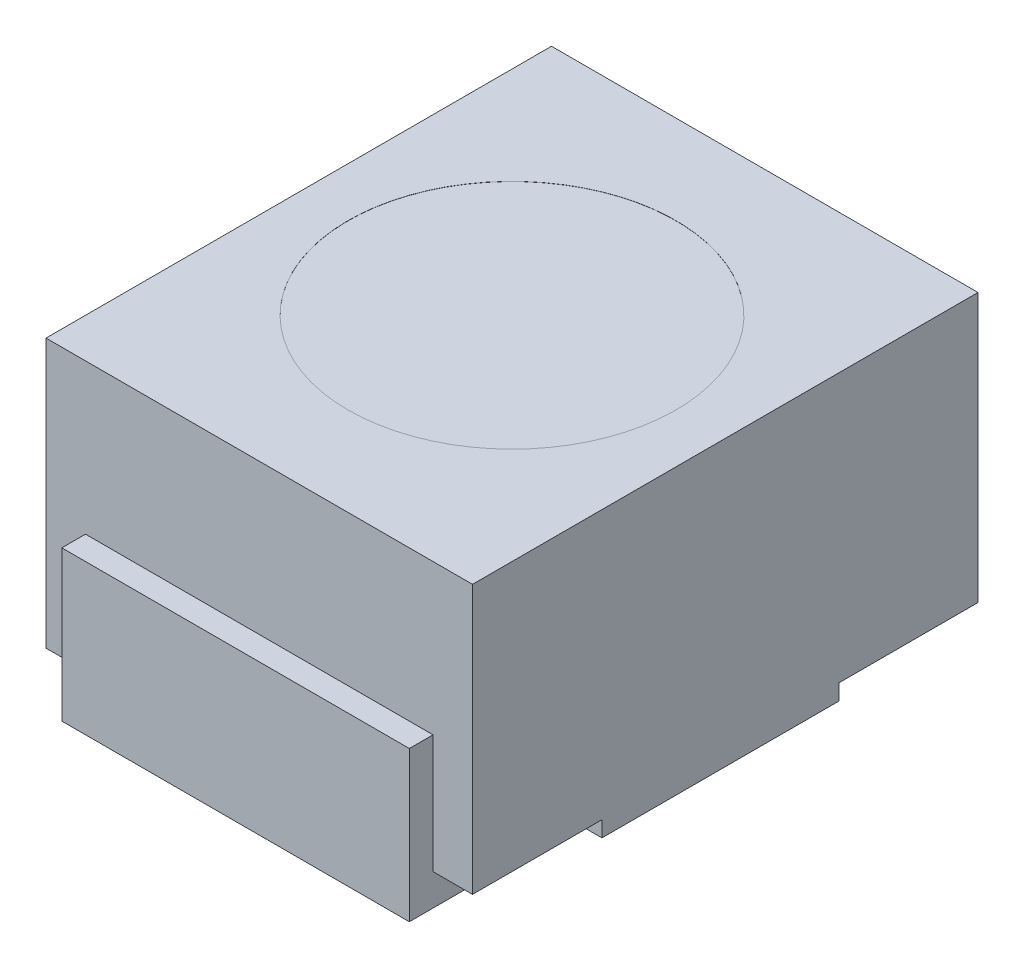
ISO-10303-21;
HEADER;
FILE_DESCRIPTION(('STEP AP214'),'2;1');
FILE_NAME('part.step','',(''),(''),'','','');
FILE_SCHEMA(('AUTOMOTIVE_DESIGN { 1 0 10303 214 1 1 1 1 }'));
ENDSEC;
DATA;
#1=APPLICATION_CONTEXT('core data for automotive mechanical design processes');
#2=APPLICATION_PROTOCOL_DEFINITION('international standard','automotive_design',2000,#1);
#3=PRODUCT_CONTEXT('',#1,'mechanical');
#4=PRODUCT('Part','Part','',(#3));
#5=PRODUCT_RELATED_PRODUCT_CATEGORY('part','',(#4));
#6=PRODUCT_DEFINITION_FORMATION('','',#4);
#7=PRODUCT_DEFINITION_CONTEXT('part definition',#1,'design');
#8=PRODUCT_DEFINITION('design','',#6,#7);
#9=PRODUCT_DEFINITION_SHAPE('','',#8);
#10=(LENGTH_UNIT() NAMED_UNIT(*) SI_UNIT(.MILLI.,.METRE.));
#11=(NAMED_UNIT(*) PLANE_ANGLE_UNIT() SI_UNIT($,.RADIAN.));
#12=(NAMED_UNIT(*) SI_UNIT($,.STERADIAN.) SOLID_ANGLE_UNIT());
#13=UNCERTAINTY_MEASURE_WITH_UNIT(LENGTH_MEASURE(1.E-05),#10,'distance_accuracy_value','');
#14=(GEOMETRIC_REPRESENTATION_CONTEXT(3) GLOBAL_UNCERTAINTY_ASSIGNED_CONTEXT((#13)) GLOBAL_UNIT_ASSIGNED_CONTEXT((#10,
#11,#12)) REPRESENTATION_CONTEXT('',''));
#15=CARTESIAN_POINT('',(0.,0.,0.));
#16=DIRECTION('',(0.,0.,1.));
#17=DIRECTION('',(1.,0.,0.));
#18=AXIS2_PLACEMENT_3D('',#15,#16,#17);
#19=CARTESIAN_POINT('',(-1.35,0.2,-1.43130790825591));
#20=DIRECTION('',(0.,-1.,0.));
#21=DIRECTION('',(0.,0.,-1.));
#22=AXIS2_PLACEMENT_3D('',#19,#20,#21);
#23=PLANE('',#22);
#24=DIRECTION('',(0.,0.,1.));
#25=VECTOR('',#24,1.);
#26=CARTESIAN_POINT('',(-1.1,0.2,-1.6));
#27=LINE('',#26,#25);
#28=CARTESIAN_POINT('',(-1.1,0.2,-1.6));
#29=VERTEX_POINT('',#28);
#30=CARTESIAN_POINT('',(-1.1,0.2,-0.856033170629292));
#31=VERTEX_POINT('',#30);
#32=EDGE_CURVE('E221',#29,#31,#27,.T.);
#33=ORIENTED_EDGE('',*,*,#32,.T.);
#34=DIRECTION('',(-1.,0.,0.));
#35=VECTOR('',#34,1.);
#36=CARTESIAN_POINT('',(-1.1,0.2,-0.856033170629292));
#37=LINE('',#36,#35);
#38=CARTESIAN_POINT('',(1.1,0.2,-0.856033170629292));
#39=VERTEX_POINT('',#38);
#40=EDGE_CURVE('E192',#39,#31,#37,.T.);
#41=ORIENTED_EDGE('',*,*,#40,.F.);
#42=DIRECTION('',(0.,0.,-1.));
#43=VECTOR('',#42,1.);
#44=CARTESIAN_POINT('',(1.1,0.2,-1.6));
#45=LINE('',#44,#43);
#46=CARTESIAN_POINT('',(1.1,0.2,-1.6));
#47=VERTEX_POINT('',#46);
#48=EDGE_CURVE('E188',#39,#47,#45,.T.);
#49=ORIENTED_EDGE('',*,*,#48,.T.);
#50=DIRECTION('',(1.,0.,0.));
#51=VECTOR('',#50,1.);
#52=CARTESIAN_POINT('',(1.1,0.2,-1.6));
#53=LINE('',#52,#51);
#54=CARTESIAN_POINT('',(1.35,0.2,-1.6));
#55=VERTEX_POINT('',#54);
#56=EDGE_CURVE('E216',#47,#55,#53,.T.);
#57=ORIENTED_EDGE('',*,*,#56,.T.);
#58=DIRECTION('',(0.,0.,1.));
#59=VECTOR('',#58,1.);
#60=CARTESIAN_POINT('',(1.35,0.2,1.39706609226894));
#61=LINE('',#60,#59);
#62=CARTESIAN_POINT('',(1.35,0.2,-0.719286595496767));
#63=VERTEX_POINT('',#62);
#64=EDGE_CURVE('E258',#55,#63,#61,.T.);
#65=ORIENTED_EDGE('',*,*,#64,.T.);
#66=DIRECTION('',(1.,0.,0.));
#67=VECTOR('',#66,1.);
#68=CARTESIAN_POINT('',(-1.35,0.2,-0.719286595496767));
#69=LINE('',#68,#67);
#70=CARTESIAN_POINT('',(-1.35,0.2,-0.719286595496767));
#71=VERTEX_POINT('',#70);
#72=EDGE_CURVE('E231',#71,#63,#69,.T.);
#73=ORIENTED_EDGE('',*,*,#72,.F.);
#74=DIRECTION('',(0.,0.,-1.));
#75=VECTOR('',#74,1.);
#76=CARTESIAN_POINT('',(-1.35,0.2,1.39706609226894));
#77=LINE('',#76,#75);
#78=CARTESIAN_POINT('',(-1.35,0.2,-1.6));
#79=VERTEX_POINT('',#78);
#80=EDGE_CURVE('E254',#71,#79,#77,.T.);
#81=ORIENTED_EDGE('',*,*,#80,.T.);
#82=DIRECTION('',(1.,0.,0.));
#83=VECTOR('',#82,1.);
#84=CARTESIAN_POINT('',(-1.35,0.2,-1.6));
#85=LINE('',#84,#83);
#86=EDGE_CURVE('E219',#79,#29,#85,.T.);
#87=ORIENTED_EDGE('',*,*,#86,.T.);
#88=EDGE_LOOP('',(#33,#41,#49,#57,#65,#73,#81,#87));
#89=FACE_BOUND('',#88,.T.);
#90=ADVANCED_FACE('F32',(#89),#23,.T.);
#91=DIRECTION('',(1.,0.,0.));
#92=VECTOR('',#91,1.);
#93=CARTESIAN_POINT('',(-1.1,0.2,0.941636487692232));
#94=LINE('',#93,#92);
#95=CARTESIAN_POINT('',(-1.1,0.2,0.941636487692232));
#96=VERTEX_POINT('',#95);
#97=CARTESIAN_POINT('',(1.1,0.2,0.941636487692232));
#98=VERTEX_POINT('',#97);
#99=EDGE_CURVE('E201',#96,#98,#94,.T.);
#100=ORIENTED_EDGE('',*,*,#99,.F.);
#101=DIRECTION('',(0.,0.,1.));
#102=VECTOR('',#101,1.);
#103=CARTESIAN_POINT('',(-1.1,0.2,1.6));
#104=LINE('',#103,#102);
#105=CARTESIAN_POINT('',(-1.1,0.2,1.6));
#106=VERTEX_POINT('',#105);
#107=EDGE_CURVE('E226',#96,#106,#104,.T.);
#108=ORIENTED_EDGE('',*,*,#107,.T.);
#109=DIRECTION('',(-1.,0.,0.));
#110=VECTOR('',#109,1.);
#111=CARTESIAN_POINT('',(-1.1,0.2,1.6));
#112=LINE('',#111,#110);
#113=CARTESIAN_POINT('',(-1.35,0.2,1.6));
#114=VERTEX_POINT('',#113);
#115=EDGE_CURVE('E228',#106,#114,#112,.T.);
#116=ORIENTED_EDGE('',*,*,#115,.T.);
#117=CARTESIAN_POINT('',(-1.35,0.2,0.780713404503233));
#118=VERTEX_POINT('',#117);
#119=EDGE_CURVE('E255',#114,#118,#77,.T.);
#120=ORIENTED_EDGE('',*,*,#119,.T.);
#121=DIRECTION('',(-1.,0.,0.));
#122=VECTOR('',#121,1.);
#123=CARTESIAN_POINT('',(-1.35,0.2,0.780713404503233));
#124=LINE('',#123,#122);
#125=CARTESIAN_POINT('',(1.35,0.2,0.780713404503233));
#126=VERTEX_POINT('',#125);
#127=EDGE_CURVE('E236',#126,#118,#124,.T.);
#128=ORIENTED_EDGE('',*,*,#127,.F.);
#129=CARTESIAN_POINT('',(1.35,0.2,1.6));
#130=VERTEX_POINT('',#129);
#131=EDGE_CURVE('E257',#126,#130,#61,.T.);
#132=ORIENTED_EDGE('',*,*,#131,.T.);
#133=DIRECTION('',(-1.,0.,0.));
#134=VECTOR('',#133,1.);
#135=CARTESIAN_POINT('',(1.1,0.2,1.6));
#136=LINE('',#135,#134);
#137=CARTESIAN_POINT('',(1.1,0.2,1.6));
#138=VERTEX_POINT('',#137);
#139=EDGE_CURVE('E224',#130,#138,#136,.T.);
#140=ORIENTED_EDGE('',*,*,#139,.T.);
#141=DIRECTION('',(0.,0.,-1.));
#142=VECTOR('',#141,1.);
#143=CARTESIAN_POINT('',(1.1,0.2,1.6));
#144=LINE('',#143,#142);
#145=EDGE_CURVE('E49',#138,#98,#144,.T.);
#146=ORIENTED_EDGE('',*,*,#145,.T.);
#147=EDGE_LOOP('',(#100,#108,#116,#120,#128,#132,#140,#146));
#148=FACE_BOUND('',#147,.T.);
#149=ADVANCED_FACE('F383',(#148),#23,.T.);
#150=CARTESIAN_POINT('',(1.35,0.,-1.6));
#151=DIRECTION('',(0.,-1.,0.));
#152=DIRECTION('',(0.,0.,-1.));
#153=AXIS2_PLACEMENT_3D('',#150,#151,#152);
#154=PLANE('',#153);
#155=DIRECTION('',(0.,0.,1.));
#156=VECTOR('',#155,1.);
#157=CARTESIAN_POINT('',(1.1,0.,-1.6));
#158=LINE('',#157,#156);
#159=CARTESIAN_POINT('',(1.1,0.,-1.75));
#160=VERTEX_POINT('',#159);
#161=CARTESIAN_POINT('',(1.1,0.,-0.856033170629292));
#162=VERTEX_POINT('',#161);
#163=EDGE_CURVE('E174',#160,#162,#158,.T.);
#164=ORIENTED_EDGE('',*,*,#163,.T.);
#165=DIRECTION('',(-1.,0.,0.));
#166=VECTOR('',#165,1.);
#167=CARTESIAN_POINT('',(-1.1,0.,-0.856033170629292));
#168=LINE('',#167,#166);
#169=CARTESIAN_POINT('',(-1.1,0.,-0.856033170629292));
#170=VERTEX_POINT('',#169);
#171=EDGE_CURVE('E179',#162,#170,#168,.T.);
#172=ORIENTED_EDGE('',*,*,#171,.T.);
#173=DIRECTION('',(0.,0.,-1.));
#174=VECTOR('',#173,1.);
#175=CARTESIAN_POINT('',(-1.1,0.,-1.6));
#176=LINE('',#175,#174);
#177=CARTESIAN_POINT('',(-1.1,0.,-1.75));
#178=VERTEX_POINT('',#177);
#179=EDGE_CURVE('E260',#170,#178,#176,.T.);
#180=ORIENTED_EDGE('',*,*,#179,.T.);
#181=DIRECTION('',(1.,0.,0.));
#182=VECTOR('',#181,1.);
#183=CARTESIAN_POINT('',(-1.1,0.,-1.75));
#184=LINE('',#183,#182);
#185=EDGE_CURVE('E181',#178,#160,#184,.T.);
#186=ORIENTED_EDGE('',*,*,#185,.T.);
#187=EDGE_LOOP('',(#164,#172,#180,#186));
#188=FACE_BOUND('',#187,.T.);
#189=ADVANCED_FACE('F176',(#188),#154,.T.);
#190=DIRECTION('',(0.,0.,-1.));
#191=VECTOR('',#190,1.);
#192=CARTESIAN_POINT('',(-1.1,0.,1.75));
#193=LINE('',#192,#191);
#194=CARTESIAN_POINT('',(-1.1,0.,1.75));
#195=VERTEX_POINT('',#194);
#196=CARTESIAN_POINT('',(-1.1,0.,0.941636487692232));
#197=VERTEX_POINT('',#196);
#198=EDGE_CURVE('E282',#195,#197,#193,.T.);
#199=ORIENTED_EDGE('',*,*,#198,.T.);
#200=DIRECTION('',(1.,0.,0.));
#201=VECTOR('',#200,1.);
#202=CARTESIAN_POINT('',(-1.1,0.,0.941636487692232));
#203=LINE('',#202,#201);
#204=CARTESIAN_POINT('',(1.1,0.,0.941636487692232));
#205=VERTEX_POINT('',#204);
#206=EDGE_CURVE('E211',#197,#205,#203,.T.);
#207=ORIENTED_EDGE('',*,*,#206,.T.);
#208=DIRECTION('',(0.,0.,1.));
#209=VECTOR('',#208,1.);
#210=CARTESIAN_POINT('',(1.1,0.,1.75));
#211=LINE('',#210,#209);
#212=CARTESIAN_POINT('',(1.1,0.,1.75));
#213=VERTEX_POINT('',#212);
#214=EDGE_CURVE('E308',#205,#213,#211,.T.);
#215=ORIENTED_EDGE('',*,*,#214,.T.);
#216=DIRECTION('',(-1.,0.,0.));
#217=VECTOR('',#216,1.);
#218=CARTESIAN_POINT('',(-1.1,0.,1.75));
#219=LINE('',#218,#217);
#220=EDGE_CURVE('E296',#213,#195,#219,.T.);
#221=ORIENTED_EDGE('',*,*,#220,.T.);
#222=EDGE_LOOP('',(#199,#207,#215,#221));
#223=FACE_BOUND('',#222,.T.);
#224=ADVANCED_FACE('F356',(#223),#154,.T.);
#225=CARTESIAN_POINT('',(-1.35,1.9,1.6));
#226=DIRECTION('',(0.,0.,-1.));
#227=DIRECTION('',(-1.,0.,0.));
#228=AXIS2_PLACEMENT_3D('',#225,#226,#227);
#229=PLANE('',#228);
#230=ORIENTED_EDGE('',*,*,#139,.F.);
#231=DIRECTION('',(0.,-1.,0.));
#232=VECTOR('',#231,1.);
#233=CARTESIAN_POINT('',(1.35,1.9,1.6));
#234=LINE('',#233,#232);
#235=CARTESIAN_POINT('',(1.35,1.9,1.6));
#236=VERTEX_POINT('',#235);
#237=EDGE_CURVE('E350',#236,#130,#234,.T.);
#238=ORIENTED_EDGE('',*,*,#237,.F.);
#239=DIRECTION('',(1.,0.,0.));
#240=VECTOR('',#239,1.);
#241=CARTESIAN_POINT('',(-1.35,1.9,1.6));
#242=LINE('',#241,#240);
#243=CARTESIAN_POINT('',(-1.35,1.9,1.6));
#244=VERTEX_POINT('',#243);
#245=EDGE_CURVE('E639',#244,#236,#242,.T.);
#246=ORIENTED_EDGE('',*,*,#245,.F.);
#247=DIRECTION('',(0.,-1.,0.));
#248=VECTOR('',#247,1.);
#249=CARTESIAN_POINT('',(-1.35,1.9,1.6));
#250=LINE('',#249,#248);
#251=EDGE_CURVE('E347',#244,#114,#250,.T.);
#252=ORIENTED_EDGE('',*,*,#251,.T.);
#253=ORIENTED_EDGE('',*,*,#115,.F.);
#254=DIRECTION('',(0.,-1.,0.));
#255=VECTOR('',#254,1.);
#256=CARTESIAN_POINT('',(-1.1,0.95,1.6));
#257=LINE('',#256,#255);
#258=CARTESIAN_POINT('',(-1.1,0.95,1.6));
#259=VERTEX_POINT('',#258);
#260=EDGE_CURVE('E305',#259,#106,#257,.T.);
#261=ORIENTED_EDGE('',*,*,#260,.F.);
#262=DIRECTION('',(1.,0.,0.));
#263=VECTOR('',#262,1.);
#264=CARTESIAN_POINT('',(-1.1,0.95,1.6));
#265=LINE('',#264,#263);
#266=CARTESIAN_POINT('',(1.1,0.95,1.6));
#267=VERTEX_POINT('',#266);
#268=EDGE_CURVE('E295',#259,#267,#265,.T.);
#269=ORIENTED_EDGE('',*,*,#268,.T.);
#270=DIRECTION('',(0.,-1.,0.));
#271=VECTOR('',#270,1.);
#272=CARTESIAN_POINT('',(1.1,0.95,1.6));
#273=LINE('',#272,#271);
#274=EDGE_CURVE('E314',#267,#138,#273,.T.);
#275=ORIENTED_EDGE('',*,*,#274,.T.);
#276=EDGE_LOOP('',(#230,#238,#246,#252,#253,#261,#269,#275));
#277=FACE_BOUND('',#276,.T.);
#278=ADVANCED_FACE('F521',(#277),#229,.F.);
#279=CARTESIAN_POINT('',(1.35,1.9,1.6));
#280=DIRECTION('',(-1.,0.,0.));
#281=DIRECTION('',(0.,0.,1.));
#282=AXIS2_PLACEMENT_3D('',#279,#280,#281);
#283=PLANE('',#282);
#284=ORIENTED_EDGE('',*,*,#64,.F.);
#285=DIRECTION('',(0.,-1.,0.));
#286=VECTOR('',#285,1.);
#287=CARTESIAN_POINT('',(1.35,1.9,-1.6));
#288=LINE('',#287,#286);
#289=CARTESIAN_POINT('',(1.35,1.9,-1.6));
#290=VERTEX_POINT('',#289);
#291=EDGE_CURVE('E11',#290,#55,#288,.T.);
#292=ORIENTED_EDGE('',*,*,#291,.F.);
#293=DIRECTION('',(0.,0.,-1.));
#294=VECTOR('',#293,1.);
#295=CARTESIAN_POINT('',(1.35,1.9,1.6));
#296=LINE('',#295,#294);
#297=EDGE_CURVE('E311',#236,#290,#296,.T.);
#298=ORIENTED_EDGE('',*,*,#297,.F.);
#299=ORIENTED_EDGE('',*,*,#237,.T.);
#300=ORIENTED_EDGE('',*,*,#131,.F.);
#301=DIRECTION('',(0.,1.,0.));
#302=VECTOR('',#301,1.);
#303=CARTESIAN_POINT('',(1.35,0.1,0.780713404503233));
#304=LINE('',#303,#302);
#305=CARTESIAN_POINT('',(1.35,0.1,0.780713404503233));
#306=VERTEX_POINT('',#305);
#307=EDGE_CURVE('E57',#306,#126,#304,.T.);
#308=ORIENTED_EDGE('',*,*,#307,.F.);
#309=DIRECTION('',(0.,0.,1.));
#310=VECTOR('',#309,1.);
#311=CARTESIAN_POINT('',(1.35,0.1,0.780713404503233));
#312=LINE('',#311,#310);
#313=CARTESIAN_POINT('',(1.35,0.1,-0.719286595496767));
#314=VERTEX_POINT('',#313);
#315=EDGE_CURVE('E238',#314,#306,#312,.T.);
#316=ORIENTED_EDGE('',*,*,#315,.F.);
#317=DIRECTION('',(0.,1.,0.));
#318=VECTOR('',#317,1.);
#319=CARTESIAN_POINT('',(1.35,0.1,-0.719286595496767));
#320=LINE('',#319,#318);
#321=EDGE_CURVE('E249',#314,#63,#320,.T.);
#322=ORIENTED_EDGE('',*,*,#321,.T.);
#323=EDGE_LOOP('',(#284,#292,#298,#299,#300,#308,#316,#322));
#324=FACE_BOUND('',#323,.T.);
#325=ADVANCED_FACE('F34',(#324),#283,.F.);
#326=CARTESIAN_POINT('',(-1.35,1.9,-1.6));
#327=DIRECTION('',(0.,0.,1.));
#328=DIRECTION('',(1.,0.,0.));
#329=AXIS2_PLACEMENT_3D('',#326,#327,#328);
#330=PLANE('',#329);
#331=ORIENTED_EDGE('',*,*,#291,.T.);
#332=ORIENTED_EDGE('',*,*,#56,.F.);
#333=DIRECTION('',(0.,-1.,0.));
#334=VECTOR('',#333,1.);
#335=CARTESIAN_POINT('',(1.1,0.95,-1.6));
#336=LINE('',#335,#334);
#337=CARTESIAN_POINT('',(1.1,0.95,-1.6));
#338=VERTEX_POINT('',#337);
#339=EDGE_CURVE('E283',#338,#47,#336,.T.);
#340=ORIENTED_EDGE('',*,*,#339,.F.);
#341=DIRECTION('',(-1.,0.,0.));
#342=VECTOR('',#341,1.);
#343=CARTESIAN_POINT('',(-1.1,0.95,-1.6));
#344=LINE('',#343,#342);
#345=CARTESIAN_POINT('',(-1.1,0.95,-1.6));
#346=VERTEX_POINT('',#345);
#347=EDGE_CURVE('E268',#338,#346,#344,.T.);
#348=ORIENTED_EDGE('',*,*,#347,.T.);
#349=DIRECTION('',(0.,-1.,0.));
#350=VECTOR('',#349,1.);
#351=CARTESIAN_POINT('',(-1.1,0.95,-1.6));
#352=LINE('',#351,#350);
#353=EDGE_CURVE('E278',#346,#29,#352,.T.);
#354=ORIENTED_EDGE('',*,*,#353,.T.);
#355=ORIENTED_EDGE('',*,*,#86,.F.);
#356=DIRECTION('',(0.,-1.,0.));
#357=VECTOR('',#356,1.);
#358=CARTESIAN_POINT('',(-1.35,1.9,-1.6));
#359=LINE('',#358,#357);
#360=CARTESIAN_POINT('',(-1.35,1.9,-1.6));
#361=VERTEX_POINT('',#360);
#362=EDGE_CURVE('E41',#361,#79,#359,.T.);
#363=ORIENTED_EDGE('',*,*,#362,.F.);
#364=DIRECTION('',(-1.,0.,0.));
#365=VECTOR('',#364,1.);
#366=CARTESIAN_POINT('',(-1.35,1.9,-1.6));
#367=LINE('',#366,#365);
#368=EDGE_CURVE('E637',#290,#361,#367,.T.);
#369=ORIENTED_EDGE('',*,*,#368,.F.);
#370=EDGE_LOOP('',(#331,#332,#340,#348,#354,#355,#363,#369));
#371=FACE_BOUND('',#370,.T.);
#372=ADVANCED_FACE('F340',(#371),#330,.F.);
#373=CARTESIAN_POINT('',(-1.35,1.9,1.6));
#374=DIRECTION('',(1.,0.,0.));
#375=DIRECTION('',(0.,0.,-1.));
#376=AXIS2_PLACEMENT_3D('',#373,#374,#375);
#377=PLANE('',#376);
#378=ORIENTED_EDGE('',*,*,#362,.T.);
#379=ORIENTED_EDGE('',*,*,#80,.F.);
#380=DIRECTION('',(0.,1.,0.));
#381=VECTOR('',#380,1.);
#382=CARTESIAN_POINT('',(-1.35,0.1,-0.719286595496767));
#383=LINE('',#382,#381);
#384=CARTESIAN_POINT('',(-1.35,0.1,-0.719286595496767));
#385=VERTEX_POINT('',#384);
#386=EDGE_CURVE('E252',#385,#71,#383,.T.);
#387=ORIENTED_EDGE('',*,*,#386,.F.);
#388=DIRECTION('',(0.,0.,-1.));
#389=VECTOR('',#388,1.);
#390=CARTESIAN_POINT('',(-1.35,0.1,0.780713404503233));
#391=LINE('',#390,#389);
#392=CARTESIAN_POINT('',(-1.35,0.1,0.780713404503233));
#393=VERTEX_POINT('',#392);
#394=EDGE_CURVE('E232',#393,#385,#391,.T.);
#395=ORIENTED_EDGE('',*,*,#394,.F.);
#396=DIRECTION('',(0.,1.,0.));
#397=VECTOR('',#396,1.);
#398=CARTESIAN_POINT('',(-1.35,0.1,0.780713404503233));
#399=LINE('',#398,#397);
#400=EDGE_CURVE('E242',#393,#118,#399,.T.);
#401=ORIENTED_EDGE('',*,*,#400,.T.);
#402=ORIENTED_EDGE('',*,*,#119,.F.);
#403=ORIENTED_EDGE('',*,*,#251,.F.);
#404=DIRECTION('',(0.,0.,1.));
#405=VECTOR('',#404,1.);
#406=CARTESIAN_POINT('',(-1.35,1.9,1.6));
#407=LINE('',#406,#405);
#408=EDGE_CURVE('E346',#361,#244,#407,.T.);
#409=ORIENTED_EDGE('',*,*,#408,.F.);
#410=EDGE_LOOP('',(#378,#379,#387,#395,#401,#402,#403,#409));
#411=FACE_BOUND('',#410,.T.);
#412=ADVANCED_FACE('F343',(#411),#377,.F.);
#413=CARTESIAN_POINT('',(1.35,1.9,-1.6));
#414=DIRECTION('',(0.,-1.,0.));
#415=DIRECTION('',(0.,0.,-1.));
#416=AXIS2_PLACEMENT_3D('',#413,#414,#415);
#417=PLANE('',#416);
#418=CARTESIAN_POINT('',(0.,1.9,0.));
#419=DIRECTION('',(0.,1.,0.));
#420=DIRECTION('',(0.,0.,1.));
#421=AXIS2_PLACEMENT_3D('',#418,#419,#420);
#422=CIRCLE('',#421,1.03822955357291);
#423=CARTESIAN_POINT('',(0.,1.9,1.03822955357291));
#424=VERTEX_POINT('',#423);
#425=EDGE_CURVE('E633',#424,#424,#422,.T.);
#426=ORIENTED_EDGE('',*,*,#425,.F.);
#427=EDGE_LOOP('',(#426));
#428=FACE_BOUND('',#427,.T.);
#429=ORIENTED_EDGE('',*,*,#297,.T.);
#430=ORIENTED_EDGE('',*,*,#368,.T.);
#431=ORIENTED_EDGE('',*,*,#408,.T.);
#432=ORIENTED_EDGE('',*,*,#245,.T.);
#433=EDGE_LOOP('',(#429,#430,#431,#432));
#434=FACE_BOUND('',#433,.T.);
#435=ADVANCED_FACE('F509',(#428,#434),#417,.F.);
#436=CARTESIAN_POINT('',(-1.1,0.95,1.75));
#437=DIRECTION('',(-1.,0.,0.));
#438=DIRECTION('',(0.,0.,1.));
#439=AXIS2_PLACEMENT_3D('',#436,#437,#438);
#440=PLANE('',#439);
#441=ORIENTED_EDGE('',*,*,#198,.F.);
#442=DIRECTION('',(0.,-1.,0.));
#443=VECTOR('',#442,1.);
#444=CARTESIAN_POINT('',(-1.1,0.95,1.75));
#445=LINE('',#444,#443);
#446=CARTESIAN_POINT('',(-1.1,0.95,1.75));
#447=VERTEX_POINT('',#446);
#448=EDGE_CURVE('E309',#447,#195,#445,.T.);
#449=ORIENTED_EDGE('',*,*,#448,.F.);
#450=DIRECTION('',(0.,0.,-1.));
#451=VECTOR('',#450,1.);
#452=CARTESIAN_POINT('',(-1.1,0.95,1.75));
#453=LINE('',#452,#451);
#454=EDGE_CURVE('E292',#447,#259,#453,.T.);
#455=ORIENTED_EDGE('',*,*,#454,.T.);
#456=ORIENTED_EDGE('',*,*,#260,.T.);
#457=ORIENTED_EDGE('',*,*,#107,.F.);
#458=DIRECTION('',(0.,1.,0.));
#459=VECTOR('',#458,1.);
#460=CARTESIAN_POINT('',(-1.1,-2.2739703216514,0.941636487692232));
#461=LINE('',#460,#459);
#462=EDGE_CURVE('E198',#197,#96,#461,.T.);
#463=ORIENTED_EDGE('',*,*,#462,.F.);
#464=EDGE_LOOP('',(#441,#449,#455,#456,#457,#463));
#465=FACE_BOUND('',#464,.T.);
#466=ADVANCED_FACE('F366',(#465),#440,.T.);
#467=CARTESIAN_POINT('',(-1.1,0.95,1.75));
#468=DIRECTION('',(0.,0.,1.));
#469=DIRECTION('',(1.,0.,0.));
#470=AXIS2_PLACEMENT_3D('',#467,#468,#469);
#471=PLANE('',#470);
#472=ORIENTED_EDGE('',*,*,#220,.F.);
#473=DIRECTION('',(0.,-1.,0.));
#474=VECTOR('',#473,1.);
#475=CARTESIAN_POINT('',(1.1,0.95,1.75));
#476=LINE('',#475,#474);
#477=CARTESIAN_POINT('',(1.1,0.95,1.75));
#478=VERTEX_POINT('',#477);
#479=EDGE_CURVE('E312',#478,#213,#476,.T.);
#480=ORIENTED_EDGE('',*,*,#479,.F.);
#481=DIRECTION('',(-1.,0.,0.));
#482=VECTOR('',#481,1.);
#483=CARTESIAN_POINT('',(-1.1,0.95,1.75));
#484=LINE('',#483,#482);
#485=EDGE_CURVE('E302',#478,#447,#484,.T.);
#486=ORIENTED_EDGE('',*,*,#485,.T.);
#487=ORIENTED_EDGE('',*,*,#448,.T.);
#488=EDGE_LOOP('',(#472,#480,#486,#487));
#489=FACE_BOUND('',#488,.T.);
#490=ADVANCED_FACE('F360',(#489),#471,.T.);
#491=CARTESIAN_POINT('',(1.1,0.95,1.75));
#492=DIRECTION('',(1.,0.,0.));
#493=DIRECTION('',(0.,0.,-1.));
#494=AXIS2_PLACEMENT_3D('',#491,#492,#493);
#495=PLANE('',#494);
#496=ORIENTED_EDGE('',*,*,#214,.F.);
#497=DIRECTION('',(0.,1.,0.));
#498=VECTOR('',#497,1.);
#499=CARTESIAN_POINT('',(1.1,-2.2739703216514,0.941636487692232));
#500=LINE('',#499,#498);
#501=EDGE_CURVE('E210',#205,#98,#500,.T.);
#502=ORIENTED_EDGE('',*,*,#501,.T.);
#503=ORIENTED_EDGE('',*,*,#145,.F.);
#504=ORIENTED_EDGE('',*,*,#274,.F.);
#505=DIRECTION('',(0.,0.,1.));
#506=VECTOR('',#505,1.);
#507=CARTESIAN_POINT('',(1.1,0.95,1.75));
#508=LINE('',#507,#506);
#509=EDGE_CURVE('E299',#267,#478,#508,.T.);
#510=ORIENTED_EDGE('',*,*,#509,.T.);
#511=ORIENTED_EDGE('',*,*,#479,.T.);
#512=EDGE_LOOP('',(#496,#502,#503,#504,#510,#511));
#513=FACE_BOUND('',#512,.T.);
#514=ADVANCED_FACE('F370',(#513),#495,.T.);
#515=CARTESIAN_POINT('',(-1.1,0.95,1.6));
#516=DIRECTION('',(0.,-1.,0.));
#517=DIRECTION('',(0.,0.,-1.));
#518=AXIS2_PLACEMENT_3D('',#515,#516,#517);
#519=PLANE('',#518);
#520=ORIENTED_EDGE('',*,*,#454,.F.);
#521=ORIENTED_EDGE('',*,*,#485,.F.);
#522=ORIENTED_EDGE('',*,*,#509,.F.);
#523=ORIENTED_EDGE('',*,*,#268,.F.);
#524=EDGE_LOOP('',(#520,#521,#522,#523));
#525=FACE_BOUND('',#524,.T.);
#526=ADVANCED_FACE('F372',(#525),#519,.F.);
#527=CARTESIAN_POINT('',(-1.1,0.95,-1.6));
#528=DIRECTION('',(-1.,0.,0.));
#529=DIRECTION('',(0.,0.,1.));
#530=AXIS2_PLACEMENT_3D('',#527,#528,#529);
#531=PLANE('',#530);
#532=ORIENTED_EDGE('',*,*,#179,.F.);
#533=DIRECTION('',(0.,1.,0.));
#534=VECTOR('',#533,1.);
#535=CARTESIAN_POINT('',(-1.1,-2.2739703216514,-0.856033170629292));
#536=LINE('',#535,#534);
#537=EDGE_CURVE('E193',#170,#31,#536,.T.);
#538=ORIENTED_EDGE('',*,*,#537,.T.);
#539=ORIENTED_EDGE('',*,*,#32,.F.);
#540=ORIENTED_EDGE('',*,*,#353,.F.);
#541=DIRECTION('',(0.,0.,-1.));
#542=VECTOR('',#541,1.);
#543=CARTESIAN_POINT('',(-1.1,0.95,-1.6));
#544=LINE('',#543,#542);
#545=CARTESIAN_POINT('',(-1.1,0.95,-1.75));
#546=VERTEX_POINT('',#545);
#547=EDGE_CURVE('E183',#346,#546,#544,.T.);
#548=ORIENTED_EDGE('',*,*,#547,.T.);
#549=DIRECTION('',(0.,-1.,0.));
#550=VECTOR('',#549,1.);
#551=CARTESIAN_POINT('',(-1.1,0.95,-1.75));
#552=LINE('',#551,#550);
#553=EDGE_CURVE('E271',#546,#178,#552,.T.);
#554=ORIENTED_EDGE('',*,*,#553,.T.);
#555=EDGE_LOOP('',(#532,#538,#539,#540,#548,#554));
#556=FACE_BOUND('',#555,.T.);
#557=ADVANCED_FACE('F330',(#556),#531,.T.);
#558=CARTESIAN_POINT('',(1.1,0.95,-1.6));
#559=DIRECTION('',(1.,0.,0.));
#560=DIRECTION('',(0.,0.,-1.));
#561=AXIS2_PLACEMENT_3D('',#558,#559,#560);
#562=PLANE('',#561);
#563=ORIENTED_EDGE('',*,*,#163,.F.);
#564=DIRECTION('',(0.,-1.,0.));
#565=VECTOR('',#564,1.);
#566=CARTESIAN_POINT('',(1.1,0.95,-1.75));
#567=LINE('',#566,#565);
#568=CARTESIAN_POINT('',(1.1,0.95,-1.75));
#569=VERTEX_POINT('',#568);
#570=EDGE_CURVE('E275',#569,#160,#567,.T.);
#571=ORIENTED_EDGE('',*,*,#570,.F.);
#572=DIRECTION('',(0.,0.,1.));
#573=VECTOR('',#572,1.);
#574=CARTESIAN_POINT('',(1.1,0.95,-1.6));
#575=LINE('',#574,#573);
#576=EDGE_CURVE('E266',#569,#338,#575,.T.);
#577=ORIENTED_EDGE('',*,*,#576,.T.);
#578=ORIENTED_EDGE('',*,*,#339,.T.);
#579=ORIENTED_EDGE('',*,*,#48,.F.);
#580=DIRECTION('',(0.,1.,0.));
#581=VECTOR('',#580,1.);
#582=CARTESIAN_POINT('',(1.1,-2.2739703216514,-0.856033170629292));
#583=LINE('',#582,#581);
#584=EDGE_CURVE('E185',#162,#39,#583,.T.);
#585=ORIENTED_EDGE('',*,*,#584,.F.);
#586=EDGE_LOOP('',(#563,#571,#577,#578,#579,#585));
#587=FACE_BOUND('',#586,.T.);
#588=ADVANCED_FACE('F186',(#587),#562,.T.);
#589=CARTESIAN_POINT('',(-1.1,0.95,-1.75));
#590=DIRECTION('',(0.,0.,-1.));
#591=DIRECTION('',(-1.,0.,0.));
#592=AXIS2_PLACEMENT_3D('',#589,#590,#591);
#593=PLANE('',#592);
#594=ORIENTED_EDGE('',*,*,#185,.F.);
#595=ORIENTED_EDGE('',*,*,#553,.F.);
#596=DIRECTION('',(1.,0.,0.));
#597=VECTOR('',#596,1.);
#598=CARTESIAN_POINT('',(-1.1,0.95,-1.75));
#599=LINE('',#598,#597);
#600=EDGE_CURVE('E263',#546,#569,#599,.T.);
#601=ORIENTED_EDGE('',*,*,#600,.T.);
#602=ORIENTED_EDGE('',*,*,#570,.T.);
#603=EDGE_LOOP('',(#594,#595,#601,#602));
#604=FACE_BOUND('',#603,.T.);
#605=ADVANCED_FACE('F396',(#604),#593,.T.);
#606=CARTESIAN_POINT('',(-1.1,0.95,-1.75));
#607=DIRECTION('',(0.,-1.,0.));
#608=DIRECTION('',(0.,0.,-1.));
#609=AXIS2_PLACEMENT_3D('',#606,#607,#608);
#610=PLANE('',#609);
#611=ORIENTED_EDGE('',*,*,#547,.F.);
#612=ORIENTED_EDGE('',*,*,#347,.F.);
#613=ORIENTED_EDGE('',*,*,#576,.F.);
#614=ORIENTED_EDGE('',*,*,#600,.F.);
#615=EDGE_LOOP('',(#611,#612,#613,#614));
#616=FACE_BOUND('',#615,.T.);
#617=ADVANCED_FACE('F393',(#616),#610,.F.);
#618=CARTESIAN_POINT('',(-1.35,0.1,-0.719286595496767));
#619=DIRECTION('',(0.,0.,1.));
#620=DIRECTION('',(1.,0.,0.));
#621=AXIS2_PLACEMENT_3D('',#618,#619,#620);
#622=PLANE('',#621);
#623=ORIENTED_EDGE('',*,*,#72,.T.);
#624=ORIENTED_EDGE('',*,*,#321,.F.);
#625=DIRECTION('',(1.,0.,0.));
#626=VECTOR('',#625,1.);
#627=CARTESIAN_POINT('',(-1.35,0.1,-0.719286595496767));
#628=LINE('',#627,#626);
#629=EDGE_CURVE('E235',#385,#314,#628,.T.);
#630=ORIENTED_EDGE('',*,*,#629,.F.);
#631=ORIENTED_EDGE('',*,*,#386,.T.);
#632=EDGE_LOOP('',(#623,#624,#630,#631));
#633=FACE_BOUND('',#632,.T.);
#634=ADVANCED_FACE('F391',(#633),#622,.F.);
#635=CARTESIAN_POINT('',(-1.35,0.1,0.780713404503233));
#636=DIRECTION('',(0.,0.,-1.));
#637=DIRECTION('',(-1.,0.,0.));
#638=AXIS2_PLACEMENT_3D('',#635,#636,#637);
#639=PLANE('',#638);
#640=ORIENTED_EDGE('',*,*,#127,.T.);
#641=ORIENTED_EDGE('',*,*,#400,.F.);
#642=DIRECTION('',(-1.,0.,0.));
#643=VECTOR('',#642,1.);
#644=CARTESIAN_POINT('',(-1.35,0.1,0.780713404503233));
#645=LINE('',#644,#643);
#646=EDGE_CURVE('E240',#306,#393,#645,.T.);
#647=ORIENTED_EDGE('',*,*,#646,.F.);
#648=ORIENTED_EDGE('',*,*,#307,.T.);
#649=EDGE_LOOP('',(#640,#641,#647,#648));
#650=FACE_BOUND('',#649,.T.);
#651=ADVANCED_FACE('F426',(#650),#639,.F.);
#652=CARTESIAN_POINT('',(-1.35,0.1,-0.719286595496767));
#653=DIRECTION('',(0.,-1.,0.));
#654=DIRECTION('',(0.,0.,-1.));
#655=AXIS2_PLACEMENT_3D('',#652,#653,#654);
#656=PLANE('',#655);
#657=ORIENTED_EDGE('',*,*,#394,.T.);
#658=ORIENTED_EDGE('',*,*,#629,.T.);
#659=ORIENTED_EDGE('',*,*,#315,.T.);
#660=ORIENTED_EDGE('',*,*,#646,.T.);
#661=EDGE_LOOP('',(#657,#658,#659,#660));
#662=FACE_BOUND('',#661,.T.);
#663=ADVANCED_FACE('F433',(#662),#656,.T.);
#664=CARTESIAN_POINT('',(-1.1,-2.2739703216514,0.941636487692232));
#665=DIRECTION('',(0.,0.,1.));
#666=DIRECTION('',(1.,0.,0.));
#667=AXIS2_PLACEMENT_3D('',#664,#665,#666);
#668=PLANE('',#667);
#669=ORIENTED_EDGE('',*,*,#206,.F.);
#670=ORIENTED_EDGE('',*,*,#462,.T.);
#671=ORIENTED_EDGE('',*,*,#99,.T.);
#672=ORIENTED_EDGE('',*,*,#501,.F.);
#673=EDGE_LOOP('',(#669,#670,#671,#672));
#674=FACE_BOUND('',#673,.T.);
#675=ADVANCED_FACE('F368',(#674),#668,.F.);
#676=CARTESIAN_POINT('',(-1.1,-2.2739703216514,-0.856033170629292));
#677=DIRECTION('',(0.,0.,-1.));
#678=DIRECTION('',(-1.,0.,0.));
#679=AXIS2_PLACEMENT_3D('',#676,#677,#678);
#680=PLANE('',#679);
#681=ORIENTED_EDGE('',*,*,#171,.F.);
#682=ORIENTED_EDGE('',*,*,#584,.T.);
#683=ORIENTED_EDGE('',*,*,#40,.T.);
#684=ORIENTED_EDGE('',*,*,#537,.F.);
#685=EDGE_LOOP('',(#681,#682,#683,#684));
#686=FACE_BOUND('',#685,.T.);
#687=ADVANCED_FACE('F196',(#686),#680,.F.);
#688=CARTESIAN_POINT('',(0.,1.899,0.));
#689=DIRECTION('',(0.,1.,0.));
#690=DIRECTION('',(0.,0.,1.));
#691=AXIS2_PLACEMENT_3D('',#688,#689,#690);
#692=CYLINDRICAL_SURFACE('',#691,1.03822955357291);
#693=CARTESIAN_POINT('',(0.,1.899,0.));
#694=DIRECTION('',(0.,1.,0.));
#695=DIRECTION('',(0.,0.,1.));
#696=AXIS2_PLACEMENT_3D('',#693,#694,#695);
#697=CIRCLE('',#696,1.03822955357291);
#698=CARTESIAN_POINT('',(0.,1.899,1.03822955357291));
#699=VERTEX_POINT('',#698);
#700=EDGE_CURVE('E207',#699,#699,#697,.T.);
#701=ORIENTED_EDGE('',*,*,#700,.F.);
#702=EDGE_LOOP('',(#701));
#703=FACE_BOUND('',#702,.T.);
#704=ORIENTED_EDGE('',*,*,#425,.T.);
#705=EDGE_LOOP('',(#704));
#706=FACE_BOUND('',#705,.T.);
#707=ADVANCED_FACE('F452',(#703,#706),#692,.F.);
#708=CARTESIAN_POINT('',(0.,1.899,0.));
#709=DIRECTION('',(0.,1.,0.));
#710=DIRECTION('',(0.,0.,1.));
#711=AXIS2_PLACEMENT_3D('',#708,#709,#710);
#712=PLANE('',#711);
#713=ORIENTED_EDGE('',*,*,#700,.T.);
#714=EDGE_LOOP('',(#713));
#715=FACE_BOUND('',#714,.T.);
#716=ADVANCED_FACE('F460',(#715),#712,.T.);
#717=CLOSED_SHELL('',(#90,#149,#189,#224,#278,#325,#372,#412,#435,#466,#490,#514,#526,#557,#588,
#605,#617,#634,#651,#663,#675,#687,#707,#716));
#718=MANIFOLD_SOLID_BREP('B2',#717);
#719=ADVANCED_BREP_SHAPE_REPRESENTATION('',(#18,#718),#14);
#720=SHAPE_DEFINITION_REPRESENTATION(#9,#719);
ENDSEC;
END-ISO-10303-21;
